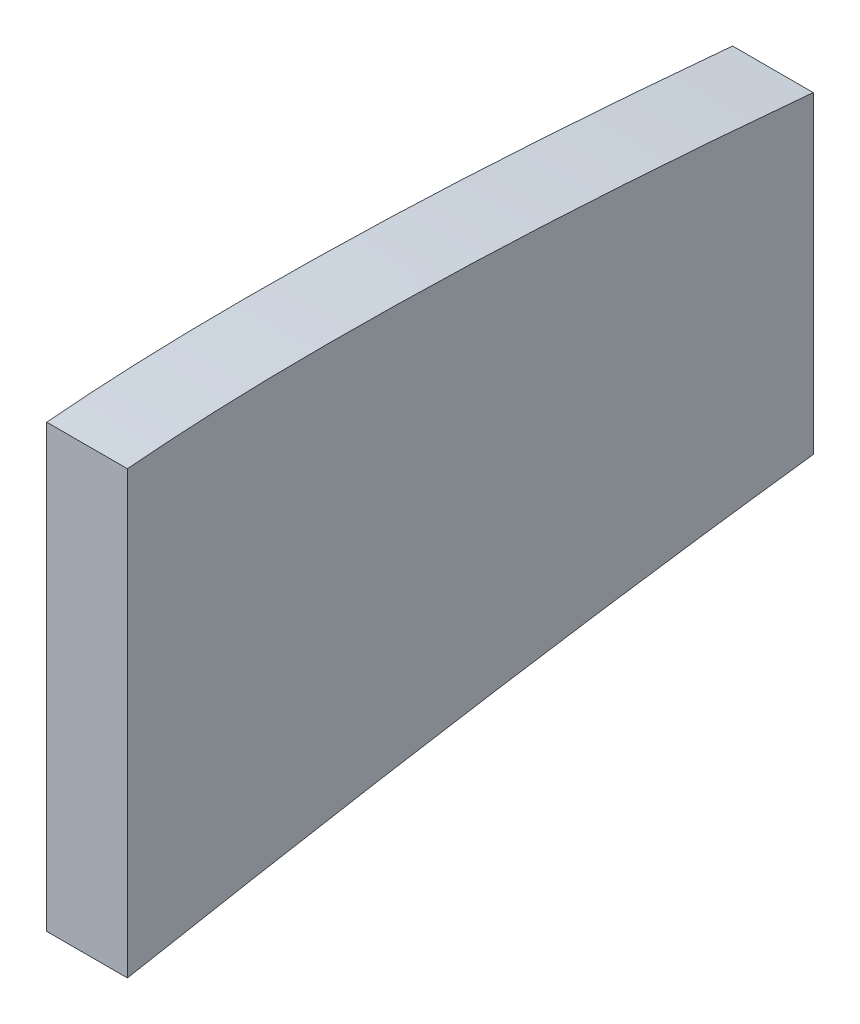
from build123d import *

# Parameters (mm, degrees)
BOSS_EXTRUDE1_DEPTH = 3.175


with BuildPart() as part:
    # Sketch1 → Boss-Extrude1 (new body)
    with BuildSketch(Plane(origin=(0, 0, 0), x_dir=(0, 0, -1), z_dir=(1, 0, 0))):
        with BuildLine():
            Line((36.5125, 19.482508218), (36.5125, 2.128273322))
            add(Edge.make_bspline(
                [(36.5125, 2.128273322), (37.814276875, 2.37241894), (41.098437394, 2.982347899), (46.473033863, 3.938047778), (52.725912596, 4.966292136), (58.436634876, 5.812638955), (62.059389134, 6.292841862), (63.5, 6.47451788)],
                knots=[0.636069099, 0.636069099, 0.636069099, 0.636069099, 0.649056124, 0.668822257, 0.689594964, 0.711189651, 0.725427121, 0.725427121, 0.725427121, 0.725427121], degree=3))
            Line((63.5, 6.47451788), (63.5, 18.808314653))
            add(Edge.make_bspline(
                [(63.5, 18.808314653), (62.647513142, 18.885870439), (60.079113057, 19.110493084), (55.847377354, 19.427565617), (50.864839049, 19.69309767), (46.069741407, 19.808676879), (41.486657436, 19.798127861), (38.324897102, 19.6365817), (36.695507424, 19.498683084), (36.5125, 19.482508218)],
                knots=[1.279493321, 1.279493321, 1.279493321, 1.279493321, 1.287886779, 1.304773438, 1.321101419, 1.336806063, 1.351800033, 1.366031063, 1.367832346, 1.367832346, 1.367832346, 1.367832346], degree=3))
        make_face()
    extrude(amount=BOSS_EXTRUDE1_DEPTH)


solid = part.part
